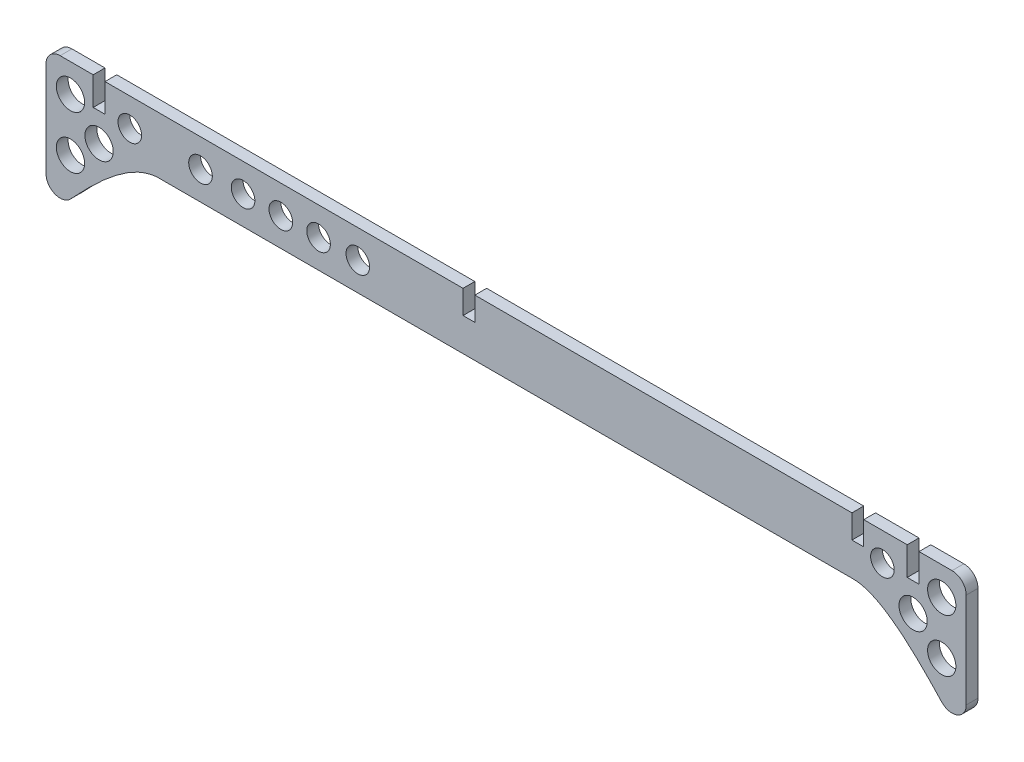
from build123d import *

# Parameters (mm, degrees)
SKETCH1_R           = 3.81
SKETCH1_R_2         = 3.175
BOSS_EXTRUDE1_DEPTH = 3.175


with BuildPart() as part:
    # Sketch1 → Boss-Extrude1 (new body)
    with BuildSketch(Plane.XY):
        with BuildLine():
            Line((107.95, 0), (111.125, 0))
            Line((111.125, 0), (111.125, 7.62))
            Line((111.125, 7.62), (120.015, 7.62))
            ThreePointArc((120.015, 7.62), (122.709076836, 6.504076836), (123.825, 3.81))
            Line((123.825, 3.81), (123.825, 0))
            Line((123.825, 0), (123.825, -21.78469975))
            ThreePointArc((123.825, -21.78469975), (121.419156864, -25.326513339), (117.239990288, -24.395335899))
            add(Edge.make_bspline(
                [(117.239990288, -24.395335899), (110.980979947, -17.742239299), (101.376457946, -7.660342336), (93.469360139, -7.62)],
                knots=[0.386367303, 0.386367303, 0.386367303, 0.386367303, 1, 1, 1, 1], degree=3))
            Line((93.469360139, -7.62), (-93.469360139, -7.62))
            add(Edge.make_bspline(
                [(-117.239990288, -24.395335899), (-110.980979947, -17.742239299), (-101.376457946, -7.660342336), (-93.469360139, -7.62)],
                knots=[0.386367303, 0.386367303, 0.386367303, 0.386367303, 1, 1, 1, 1], degree=3))
            ThreePointArc((-117.239990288, -24.395335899), (-121.419156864, -25.326513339), (-123.825, -21.78469975))
            Line((-123.825, -21.78469975), (-123.825, 0))
            Line((-123.825, 0), (-123.825, 3.81))
            ThreePointArc((-123.825, 3.81), (-122.709076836, 6.504076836), (-120.015, 7.62))
            Line((-120.015, 7.62), (-111.125, 7.62))
            Line((-111.125, 7.62), (-111.125, 0))
            Line((-111.125, 0), (-107.95, 0))
            Line((-107.95, 0), (-107.95, 7.62))
            Line((-107.95, 7.62), (-47.931287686, 7.62))
            Line((-47.931287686, 7.62), (-11.589858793, 7.62))
            Line((-11.589858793, 7.62), (-11.589858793, 1.27))
            Line((-11.589858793, 1.27), (-8.414858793, 1.27))
            Line((-8.414858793, 1.27), (-8.414858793, 7.62))
            Line((-8.414858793, 7.62), (93.073058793, 7.62))
            Line((93.073058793, 7.62), (93.073058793, 1.27))
            Line((93.073058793, 1.27), (96.248058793, 1.27))
            Line((96.248058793, 1.27), (96.248058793, 7.62))
            Line((96.248058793, 7.62), (107.95, 7.62))
            Line((107.95, 7.62), (107.95, 0))
        make_face()
        with Locations((-117.239990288, 0)):
            Circle(SKETCH1_R, mode=Mode.SUBTRACT)
        with Locations((-101.271287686, 0)):
            Circle(SKETCH1_R_2, mode=Mode.SUBTRACT)
        with Locations((-82.24155841, 0)):
            Circle(SKETCH1_R_2, mode=Mode.SUBTRACT)
        with Locations((-70.791287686, 0)):
            Circle(SKETCH1_R_2, mode=Mode.SUBTRACT)
        with Locations((-60.631287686, 0)):
            Circle(SKETCH1_R_2, mode=Mode.SUBTRACT)
        with Locations((-50.471287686, 0)):
            Circle(SKETCH1_R_2, mode=Mode.SUBTRACT)
        with Locations((-39.908225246, 0)):
            Circle(SKETCH1_R_2, mode=Mode.SUBTRACT)
        with Locations(Location((101.271287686, 0, 0), (0, 0, 180))):
            Circle(SKETCH1_R_2, mode=Mode.SUBTRACT)
        with Locations(Location((117.239990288, 0, 0), (0, 0, 180))):
            Circle(SKETCH1_R, mode=Mode.SUBTRACT)
        with Locations((-109.5375, -7.62)):
            Circle(SKETCH1_R, mode=Mode.SUBTRACT)
        with Locations((-117.239990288, -14.212538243)):
            Circle(SKETCH1_R, mode=Mode.SUBTRACT)
        with Locations(Location((117.239990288, -14.212538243, 0), (0, 0, 180))):
            Circle(SKETCH1_R, mode=Mode.SUBTRACT)
        with Locations(Location((109.5375, -7.62, 0), (0, 0, 180))):
            Circle(SKETCH1_R, mode=Mode.SUBTRACT)
    extrude(amount=BOSS_EXTRUDE1_DEPTH)


solid = part.part
